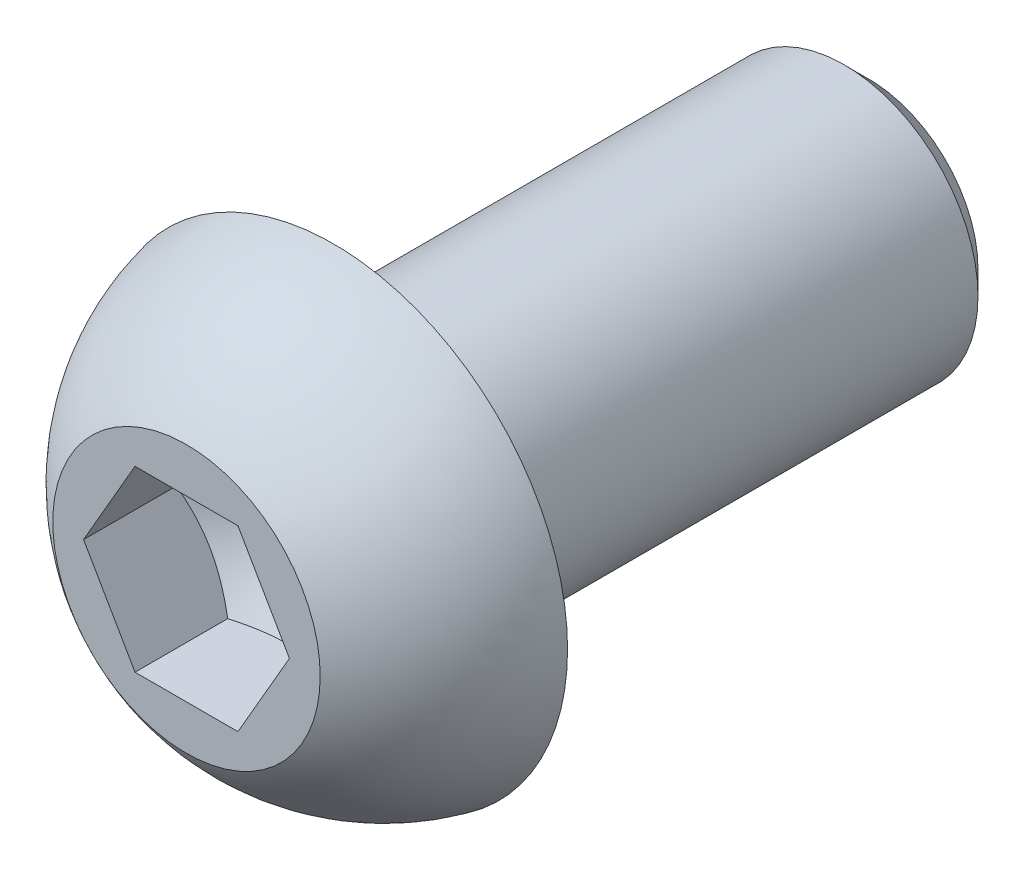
ISO-10303-21;
HEADER;
FILE_DESCRIPTION(('STEP AP214'),'2;1');
FILE_NAME('part.step','',(''),(''),'','','');
FILE_SCHEMA(('AUTOMOTIVE_DESIGN { 1 0 10303 214 1 1 1 1 }'));
ENDSEC;
DATA;
#1=APPLICATION_CONTEXT('core data for automotive mechanical design processes');
#2=APPLICATION_PROTOCOL_DEFINITION('international standard','automotive_design',2000,#1);
#3=PRODUCT_CONTEXT('',#1,'mechanical');
#4=PRODUCT('Part','Part','',(#3));
#5=PRODUCT_RELATED_PRODUCT_CATEGORY('part','',(#4));
#6=PRODUCT_DEFINITION_FORMATION('','',#4);
#7=PRODUCT_DEFINITION_CONTEXT('part definition',#1,'design');
#8=PRODUCT_DEFINITION('design','',#6,#7);
#9=PRODUCT_DEFINITION_SHAPE('','',#8);
#10=(LENGTH_UNIT() NAMED_UNIT(*) SI_UNIT(.MILLI.,.METRE.));
#11=(NAMED_UNIT(*) PLANE_ANGLE_UNIT() SI_UNIT($,.RADIAN.));
#12=(NAMED_UNIT(*) SI_UNIT($,.STERADIAN.) SOLID_ANGLE_UNIT());
#13=UNCERTAINTY_MEASURE_WITH_UNIT(LENGTH_MEASURE(1.E-05),#10,'distance_accuracy_value','');
#14=(GEOMETRIC_REPRESENTATION_CONTEXT(3) GLOBAL_UNCERTAINTY_ASSIGNED_CONTEXT((#13)) GLOBAL_UNIT_ASSIGNED_CONTEXT((#10,
#11,#12)) REPRESENTATION_CONTEXT('',''));
#15=CARTESIAN_POINT('',(0.,0.,0.));
#16=DIRECTION('',(0.,0.,1.));
#17=DIRECTION('',(1.,0.,0.));
#18=AXIS2_PLACEMENT_3D('',#15,#16,#17);
#19=CARTESIAN_POINT('',(0.,3.,3.3));
#20=DIRECTION('',(0.,0.,-1.));
#21=DIRECTION('',(-1.,0.,0.));
#22=AXIS2_PLACEMENT_3D('',#19,#20,#21);
#23=PLANE('',#22);
#24=CARTESIAN_POINT('',(0.,0.,3.3));
#25=DIRECTION('',(0.,0.,1.));
#26=DIRECTION('',(1.,0.,0.));
#27=AXIS2_PLACEMENT_3D('',#24,#25,#26);
#28=CIRCLE('',#27,3.);
#29=CARTESIAN_POINT('',(3.,0.,3.3));
#30=VERTEX_POINT('',#29);
#31=EDGE_CURVE('E111',#30,#30,#28,.T.);
#32=ORIENTED_EDGE('',*,*,#31,.T.);
#33=EDGE_LOOP('',(#32));
#34=FACE_BOUND('',#33,.T.);
#35=DIRECTION('',(0.5,-0.866025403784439,0.));
#36=VECTOR('',#35,1.);
#37=CARTESIAN_POINT('',(1.1547,1.99999906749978,3.3));
#38=LINE('',#37,#36);
#39=CARTESIAN_POINT('',(1.1547,1.99999906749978,3.3));
#40=VERTEX_POINT('',#39);
#41=CARTESIAN_POINT('',(2.3094,0.,3.3));
#42=VERTEX_POINT('',#41);
#43=EDGE_CURVE('E32',#40,#42,#38,.T.);
#44=ORIENTED_EDGE('',*,*,#43,.T.);
#45=DIRECTION('',(-0.5,-0.866025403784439,0.));
#46=VECTOR('',#45,1.);
#47=CARTESIAN_POINT('',(2.3094,0.,3.3));
#48=LINE('',#47,#46);
#49=CARTESIAN_POINT('',(1.1547,-1.99999906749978,3.3));
#50=VERTEX_POINT('',#49);
#51=EDGE_CURVE('E335',#42,#50,#48,.T.);
#52=ORIENTED_EDGE('',*,*,#51,.T.);
#53=DIRECTION('',(-1.,0.,0.));
#54=VECTOR('',#53,1.);
#55=CARTESIAN_POINT('',(1.1547,-1.99999906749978,3.3));
#56=LINE('',#55,#54);
#57=CARTESIAN_POINT('',(-1.1547,-1.99999906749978,3.3));
#58=VERTEX_POINT('',#57);
#59=EDGE_CURVE('E338',#50,#58,#56,.T.);
#60=ORIENTED_EDGE('',*,*,#59,.T.);
#61=DIRECTION('',(-0.5,0.866025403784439,0.));
#62=VECTOR('',#61,1.);
#63=CARTESIAN_POINT('',(-1.1547,-1.99999906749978,3.3));
#64=LINE('',#63,#62);
#65=CARTESIAN_POINT('',(-2.3094,0.,3.3));
#66=VERTEX_POINT('',#65);
#67=EDGE_CURVE('E341',#58,#66,#64,.T.);
#68=ORIENTED_EDGE('',*,*,#67,.T.);
#69=DIRECTION('',(0.5,0.866025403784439,0.));
#70=VECTOR('',#69,1.);
#71=CARTESIAN_POINT('',(-2.3094,0.,3.3));
#72=LINE('',#71,#70);
#73=CARTESIAN_POINT('',(-1.1547,1.99999906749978,3.3));
#74=VERTEX_POINT('',#73);
#75=EDGE_CURVE('E97',#66,#74,#72,.T.);
#76=ORIENTED_EDGE('',*,*,#75,.T.);
#77=DIRECTION('',(1.,0.,0.));
#78=VECTOR('',#77,1.);
#79=CARTESIAN_POINT('',(-1.1547,1.99999906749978,3.3));
#80=LINE('',#79,#78);
#81=EDGE_CURVE('E93',#74,#40,#80,.T.);
#82=ORIENTED_EDGE('',*,*,#81,.T.);
#83=EDGE_LOOP('',(#44,#52,#60,#68,#76,#82));
#84=FACE_BOUND('',#83,.T.);
#85=ADVANCED_FACE('F17',(#34,#84),#23,.F.);
#86=CARTESIAN_POINT('',(0.,0.,-12.));
#87=DIRECTION('',(0.,0.,1.));
#88=DIRECTION('',(1.,0.,0.));
#89=AXIS2_PLACEMENT_3D('',#86,#87,#88);
#90=CONICAL_SURFACE('',#89,2.45875,0.785398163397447);
#91=CARTESIAN_POINT('',(0.,0.,-11.45875));
#92=DIRECTION('',(0.,0.,1.));
#93=DIRECTION('',(1.,0.,0.));
#94=AXIS2_PLACEMENT_3D('',#91,#92,#93);
#95=CIRCLE('',#94,3.);
#96=CARTESIAN_POINT('',(3.,0.,-11.45875));
#97=VERTEX_POINT('',#96);
#98=EDGE_CURVE('E11',#97,#97,#95,.T.);
#99=ORIENTED_EDGE('',*,*,#98,.F.);
#100=EDGE_LOOP('',(#99));
#101=FACE_BOUND('',#100,.T.);
#102=CARTESIAN_POINT('',(0.,0.,-12.));
#103=DIRECTION('',(0.,0.,1.));
#104=DIRECTION('',(1.,0.,0.));
#105=AXIS2_PLACEMENT_3D('',#102,#103,#104);
#106=CIRCLE('',#105,2.45875);
#107=CARTESIAN_POINT('',(2.45875,0.,-12.));
#108=VERTEX_POINT('',#107);
#109=EDGE_CURVE('E108',#108,#108,#106,.T.);
#110=ORIENTED_EDGE('',*,*,#109,.T.);
#111=EDGE_LOOP('',(#110));
#112=FACE_BOUND('',#111,.T.);
#113=ADVANCED_FACE('F19',(#101,#112),#90,.T.);
#114=CARTESIAN_POINT('',(0.,0.,-12.));
#115=DIRECTION('',(0.,0.,1.));
#116=DIRECTION('',(1.,0.,0.));
#117=AXIS2_PLACEMENT_3D('',#114,#115,#116);
#118=CYLINDRICAL_SURFACE('',#117,3.);
#119=CARTESIAN_POINT('',(0.,0.,0.));
#120=DIRECTION('',(0.,0.,1.));
#121=DIRECTION('',(1.,0.,0.));
#122=AXIS2_PLACEMENT_3D('',#119,#120,#121);
#123=CIRCLE('',#122,3.);
#124=CARTESIAN_POINT('',(3.,0.,0.));
#125=VERTEX_POINT('',#124);
#126=EDGE_CURVE('E25',#125,#125,#123,.T.);
#127=ORIENTED_EDGE('',*,*,#126,.F.);
#128=EDGE_LOOP('',(#127));
#129=FACE_BOUND('',#128,.T.);
#130=ORIENTED_EDGE('',*,*,#98,.T.);
#131=EDGE_LOOP('',(#130));
#132=FACE_BOUND('',#131,.T.);
#133=ADVANCED_FACE('F121',(#129,#132),#118,.T.);
#134=CARTESIAN_POINT('',(0.,3.,0.));
#135=DIRECTION('',(0.,0.,1.));
#136=DIRECTION('',(1.,0.,0.));
#137=AXIS2_PLACEMENT_3D('',#134,#135,#136);
#138=PLANE('',#137);
#139=CARTESIAN_POINT('',(0.,0.,0.));
#140=DIRECTION('',(0.,0.,1.));
#141=DIRECTION('',(1.,0.,0.));
#142=AXIS2_PLACEMENT_3D('',#139,#140,#141);
#143=CIRCLE('',#142,5.25);
#144=CARTESIAN_POINT('',(5.25,0.,0.));
#145=VERTEX_POINT('',#144);
#146=EDGE_CURVE('E114',#145,#145,#143,.T.);
#147=ORIENTED_EDGE('',*,*,#146,.F.);
#148=EDGE_LOOP('',(#147));
#149=FACE_BOUND('',#148,.T.);
#150=ORIENTED_EDGE('',*,*,#126,.T.);
#151=EDGE_LOOP('',(#150));
#152=FACE_BOUND('',#151,.T.);
#153=ADVANCED_FACE('F119',(#149,#152),#138,.F.);
#154=CARTESIAN_POINT('',(0.,0.,-1.08519463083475));
#155=DIRECTION('',(0.,0.,1.));
#156=DIRECTION('',(1.,0.,0.));
#157=AXIS2_PLACEMENT_3D('',#154,#155,#156);
#158=DEGENERATE_TOROIDAL_SURFACE('',#157,0.113381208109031,5.25,.T.);
#159=ORIENTED_EDGE('',*,*,#31,.F.);
#160=EDGE_LOOP('',(#159));
#161=FACE_BOUND('',#160,.T.);
#162=ORIENTED_EDGE('',*,*,#146,.T.);
#163=EDGE_LOOP('',(#162));
#164=FACE_BOUND('',#163,.T.);
#165=ADVANCED_FACE('F132',(#161,#164),#158,.T.);
#166=CARTESIAN_POINT('',(0.,0.,-12.));
#167=DIRECTION('',(0.,0.,1.));
#168=DIRECTION('',(1.,0.,0.));
#169=AXIS2_PLACEMENT_3D('',#166,#167,#168);
#170=PLANE('',#169);
#171=ORIENTED_EDGE('',*,*,#109,.F.);
#172=EDGE_LOOP('',(#171));
#173=FACE_BOUND('',#172,.T.);
#174=ADVANCED_FACE('F130',(#173),#170,.F.);
#175=CARTESIAN_POINT('',(1.1547,1.99999906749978,-0.113332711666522));
#176=DIRECTION('',(-0.866025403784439,-0.5,0.));
#177=DIRECTION('',(-0.5,0.866025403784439,0.));
#178=AXIS2_PLACEMENT_3D('',#175,#176,#177);
#179=PLANE('',#178);
#180=DIRECTION('',(0.,0.,1.));
#181=VECTOR('',#180,1.);
#182=CARTESIAN_POINT('',(2.3094,0.,-0.113332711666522));
#183=LINE('',#182,#181);
#184=CARTESIAN_POINT('',(2.3094,0.,1.22));
#185=VERTEX_POINT('',#184);
#186=EDGE_CURVE('E106',#185,#42,#183,.T.);
#187=ORIENTED_EDGE('',*,*,#186,.T.);
#188=ORIENTED_EDGE('',*,*,#43,.F.);
#189=DIRECTION('',(0.,0.,1.));
#190=VECTOR('',#189,1.);
#191=CARTESIAN_POINT('',(1.1547,1.99999906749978,-0.113332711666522));
#192=LINE('',#191,#190);
#193=CARTESIAN_POINT('',(1.1547,1.99999906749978,1.22));
#194=VERTEX_POINT('',#193);
#195=EDGE_CURVE('E87',#194,#40,#192,.T.);
#196=ORIENTED_EDGE('',*,*,#195,.F.);
#197=CARTESIAN_POINT('',(2.30940011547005,-2.00000000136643E-07,1.22000006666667));
#198=CARTESIAN_POINT('',(2.25865804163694,0.0878876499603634,1.19069561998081));
#199=CARTESIAN_POINT('',(2.20747796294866,0.176534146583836,1.16404475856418));
#200=CARTESIAN_POINT('',(2.10423165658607,0.355361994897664,1.11752647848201));
#201=CARTESIAN_POINT('',(2.0521635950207,0.445546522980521,1.09767551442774));
#202=CARTESIAN_POINT('',(1.94867272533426,0.624797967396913,1.06677605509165));
#203=CARTESIAN_POINT('',(1.89726583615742,0.713837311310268,1.05552188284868));
#204=CARTESIAN_POINT('',(1.79421029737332,0.892334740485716,1.04208925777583));
#205=CARTESIAN_POINT('',(1.74256202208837,0.981792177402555,1.03989967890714));
#206=CARTESIAN_POINT('',(1.64606274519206,1.14893382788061,1.04446636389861));
#207=CARTESIAN_POINT('',(1.60119726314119,1.2266431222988,1.05010135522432));
#208=CARTESIAN_POINT('',(1.51175858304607,1.38155546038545,1.06795736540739));
#209=CARTESIAN_POINT('',(1.46718569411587,1.45875796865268,1.08018447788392));
#210=CARTESIAN_POINT('',(1.37756276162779,1.61398944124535,1.11074989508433));
#211=CARTESIAN_POINT('',(1.3325240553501,1.69199876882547,1.12921770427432));
#212=CARTESIAN_POINT('',(1.2431182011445,1.84685425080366,1.17113182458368));
#213=CARTESIAN_POINT('',(1.19874990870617,1.92370238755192,1.19456829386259));
#214=CARTESIAN_POINT('',(1.15469988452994,1.99999926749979,1.22000006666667));
#215=B_SPLINE_CURVE_WITH_KNOTS('',3,(#197,#198,#199,#200,#201,#202,#203,#204,#205,#206,#207,
#208,#209,#210,#211,#212,#213,#214),.UNSPECIFIED.,.F.,.F.,(4,2,2,2,2,2,2,2,4),(0.,
0.317015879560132,0.634793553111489,0.944707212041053,1.25424036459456,1.52370723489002,
1.79342362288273,2.06912103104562,2.3442773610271),.UNSPECIFIED.);
#216=EDGE_CURVE('E80',#185,#194,#215,.T.);
#217=ORIENTED_EDGE('',*,*,#216,.F.);
#218=EDGE_LOOP('',(#187,#188,#196,#217));
#219=FACE_BOUND('',#218,.T.);
#220=ADVANCED_FACE('F88',(#219),#179,.T.);
#221=CARTESIAN_POINT('',(2.3094,0.,-0.113332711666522));
#222=DIRECTION('',(-0.866025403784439,0.5,0.));
#223=DIRECTION('',(0.5,0.866025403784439,0.));
#224=AXIS2_PLACEMENT_3D('',#221,#222,#223);
#225=PLANE('',#224);
#226=DIRECTION('',(0.,0.,1.));
#227=VECTOR('',#226,1.);
#228=CARTESIAN_POINT('',(1.1547,-1.99999906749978,-0.113332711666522));
#229=LINE('',#228,#227);
#230=CARTESIAN_POINT('',(1.1547,-1.99999906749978,1.22));
#231=VERTEX_POINT('',#230);
#232=EDGE_CURVE('E104',#231,#50,#229,.T.);
#233=ORIENTED_EDGE('',*,*,#232,.T.);
#234=ORIENTED_EDGE('',*,*,#51,.F.);
#235=ORIENTED_EDGE('',*,*,#186,.F.);
#236=CARTESIAN_POINT('',(1.15469988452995,-1.99999926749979,1.22000006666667));
#237=CARTESIAN_POINT('',(1.20544195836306,-1.91211141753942,1.19069561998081));
#238=CARTESIAN_POINT('',(1.25662203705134,-1.82346492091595,1.16404475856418));
#239=CARTESIAN_POINT('',(1.35986834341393,-1.64463707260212,1.11752647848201));
#240=CARTESIAN_POINT('',(1.41193640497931,-1.55445254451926,1.09767551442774));
#241=CARTESIAN_POINT('',(1.51542727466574,-1.37520110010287,1.06677605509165));
#242=CARTESIAN_POINT('',(1.56683416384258,-1.28616175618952,1.05552188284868));
#243=CARTESIAN_POINT('',(1.66988970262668,-1.10766432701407,1.04208925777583));
#244=CARTESIAN_POINT('',(1.72153797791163,-1.01820689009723,1.03989967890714));
#245=CARTESIAN_POINT('',(1.81803725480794,-0.851065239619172,1.04446636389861));
#246=CARTESIAN_POINT('',(1.86290273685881,-0.773355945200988,1.05010135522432));
#247=CARTESIAN_POINT('',(1.95234141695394,-0.618443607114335,1.06795736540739));
#248=CARTESIAN_POINT('',(1.99691430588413,-0.541241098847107,1.08018447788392));
#249=CARTESIAN_POINT('',(2.08653723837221,-0.386009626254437,1.11074989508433));
#250=CARTESIAN_POINT('',(2.1315759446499,-0.308000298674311,1.12921770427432));
#251=CARTESIAN_POINT('',(2.2209817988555,-0.153144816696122,1.17113182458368));
#252=CARTESIAN_POINT('',(2.26535009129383,-0.0762966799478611,1.19456829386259));
#253=CARTESIAN_POINT('',(2.30940011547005,1.99999999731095E-07,1.22000006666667));
#254=B_SPLINE_CURVE_WITH_KNOTS('',3,(#236,#237,#238,#239,#240,#241,#242,#243,#244,#245,#246,
#247,#248,#249,#250,#251,#252,#253),.UNSPECIFIED.,.F.,.F.,(4,2,2,2,2,2,2,2,4),(0.,
0.317015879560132,0.63479355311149,0.944707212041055,1.25424036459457,1.52370723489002,
1.79342362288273,2.06912103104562,2.3442773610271),.UNSPECIFIED.);
#255=EDGE_CURVE('E84',#231,#185,#254,.T.);
#256=ORIENTED_EDGE('',*,*,#255,.F.);
#257=EDGE_LOOP('',(#233,#234,#235,#256));
#258=FACE_BOUND('',#257,.T.);
#259=ADVANCED_FACE('F140',(#258),#225,.T.);
#260=CARTESIAN_POINT('',(1.1547,-1.99999906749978,-0.113332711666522));
#261=DIRECTION('',(0.,1.,0.));
#262=DIRECTION('',(1.,0.,0.));
#263=AXIS2_PLACEMENT_3D('',#260,#261,#262);
#264=PLANE('',#263);
#265=DIRECTION('',(0.,0.,1.));
#266=VECTOR('',#265,1.);
#267=CARTESIAN_POINT('',(-1.1547,-1.99999906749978,-0.113332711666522));
#268=LINE('',#267,#266);
#269=CARTESIAN_POINT('',(-1.1547,-1.99999906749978,1.22));
#270=VERTEX_POINT('',#269);
#271=EDGE_CURVE('E102',#270,#58,#268,.T.);
#272=ORIENTED_EDGE('',*,*,#271,.T.);
#273=ORIENTED_EDGE('',*,*,#59,.F.);
#274=ORIENTED_EDGE('',*,*,#232,.F.);
#275=CARTESIAN_POINT('',(-2.99028884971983,-1.99999906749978,1.96367023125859));
#276=CARTESIAN_POINT('',(-2.90392200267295,-1.99999906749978,1.92223468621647));
#277=CARTESIAN_POINT('',(-2.81734475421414,-1.99999906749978,1.88122952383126));
#278=CARTESIAN_POINT('',(-2.64365731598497,-1.99999906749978,1.80032411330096));
#279=CARTESIAN_POINT('',(-2.55654703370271,-1.99999906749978,1.76042406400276));
#280=CARTESIAN_POINT('',(-2.38118192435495,-1.99999906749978,1.68175012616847));
#281=CARTESIAN_POINT('',(-2.29292335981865,-1.99999906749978,1.64298453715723));
#282=CARTESIAN_POINT('',(-2.11566562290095,-1.99999906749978,1.56719170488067));
#283=CARTESIAN_POINT('',(-2.02666648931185,-1.99999906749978,1.53016437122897));
#284=CARTESIAN_POINT('',(-1.84544164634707,-1.99999906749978,1.45736806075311));
#285=CARTESIAN_POINT('',(-1.75319241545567,-1.99999906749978,1.42165729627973));
#286=CARTESIAN_POINT('',(-1.56757813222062,-1.99999906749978,1.35320478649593));
#287=CARTESIAN_POINT('',(-1.47421295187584,-1.99999906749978,1.32046338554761));
#288=CARTESIAN_POINT('',(-1.28643386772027,-1.99999906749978,1.25888591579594));
#289=CARTESIAN_POINT('',(-1.19202295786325,-1.99999906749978,1.23004081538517));
#290=CARTESIAN_POINT('',(-1.00184812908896,-1.99999906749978,1.17724234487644));
#291=CARTESIAN_POINT('',(-0.906084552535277,-1.99999906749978,1.15328775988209));
#292=CARTESIAN_POINT('',(-0.713403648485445,-1.99999906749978,1.11154750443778));
#293=CARTESIAN_POINT('',(-0.616489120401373,-1.99999906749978,1.09374916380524));
#294=CARTESIAN_POINT('',(-0.421576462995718,-1.99999906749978,1.06548602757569));
#295=CARTESIAN_POINT('',(-0.323578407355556,-1.99999906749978,1.05502073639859));
#296=CARTESIAN_POINT('',(-0.12821235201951,-1.99999906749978,1.04239776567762));
#297=CARTESIAN_POINT('',(-0.0308508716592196,-1.99999906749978,1.04014205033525));
#298=CARTESIAN_POINT('',(0.163710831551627,-1.99999906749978,1.04386608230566));
#299=CARTESIAN_POINT('',(0.260911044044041,-1.99999906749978,1.04984633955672));
#300=CARTESIAN_POINT('',(0.500738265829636,-1.99999906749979,1.07423686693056));
#301=CARTESIAN_POINT('',(0.64290057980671,-1.99999906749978,1.0972180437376));
#302=CARTESIAN_POINT('',(0.924460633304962,-1.99999906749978,1.15647980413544));
#303=CARTESIAN_POINT('',(1.06385482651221,-1.99999906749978,1.19277641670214));
#304=CARTESIAN_POINT('',(1.27233418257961,-1.99999906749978,1.25477991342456));
#305=CARTESIAN_POINT('',(1.3424969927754,-1.99999906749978,1.27699669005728));
#306=CARTESIAN_POINT('',(1.4820922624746,-1.99999906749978,1.32348542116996));
#307=CARTESIAN_POINT('',(1.55152514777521,-1.99999906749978,1.34775609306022));
#308=CARTESIAN_POINT('',(1.68975335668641,-1.99999906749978,1.39800013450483));
#309=CARTESIAN_POINT('',(1.75854879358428,-1.99999906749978,1.4239731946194));
#310=CARTESIAN_POINT('',(1.8955975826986,-1.99999906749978,1.47734107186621));
#311=CARTESIAN_POINT('',(1.96385084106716,-1.99999906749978,1.50473612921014));
#312=CARTESIAN_POINT('',(2.13806939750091,-1.99999906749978,1.5764177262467));
#313=CARTESIAN_POINT('',(2.24368634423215,-1.99999906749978,1.62155001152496));
#314=CARTESIAN_POINT('',(2.45396648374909,-1.99999906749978,1.71399021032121));
#315=CARTESIAN_POINT('',(2.55862960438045,-1.99999906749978,1.76129828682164));
#316=CARTESIAN_POINT('',(2.87150603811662,-1.99999906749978,1.90571921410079));
#317=CARTESIAN_POINT('',(3.07857147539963,-1.99999906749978,2.00531395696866));
#318=CARTESIAN_POINT('',(3.49093332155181,-1.99999906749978,2.2086804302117));
#319=CARTESIAN_POINT('',(3.69622724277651,-1.99999906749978,2.31245714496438));
#320=CARTESIAN_POINT('',(4.10540852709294,-1.99999906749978,2.52267901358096));
#321=CARTESIAN_POINT('',(4.30929606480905,-1.99999906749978,2.62912382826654));
#322=CARTESIAN_POINT('',(4.69689950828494,-1.99999906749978,2.83371795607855));
#323=CARTESIAN_POINT('',(4.8807029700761,-1.99999906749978,2.93170196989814));
#324=CARTESIAN_POINT('',(5.24771864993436,-1.99999906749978,3.12878643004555));
#325=CARTESIAN_POINT('',(5.43093084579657,-1.99999906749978,3.22788691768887));
#326=CARTESIAN_POINT('',(5.79643429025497,-1.99999906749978,3.42667121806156));
#327=CARTESIAN_POINT('',(5.97872669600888,-1.99999906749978,3.52635290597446));
#328=CARTESIAN_POINT('',(6.34294295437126,-1.99999906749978,3.72636506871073));
#329=CARTESIAN_POINT('',(6.52486682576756,-1.99999906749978,3.82669550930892));
#330=CARTESIAN_POINT('',(6.70665829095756,-1.99999906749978,3.92726384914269));
#331=B_SPLINE_CURVE_WITH_KNOTS('',3,(#275,#276,#277,#278,#279,#280,#281,#282,#283,#284,#285,
#286,#287,#288,#289,#290,#291,#292,#293,#294,#295,#296,#297,#298,#299,#300,#301,#302,#303,#304,
#305,#306,#307,#308,#309,#310,#311,#312,#313,#314,#315,#316,#317,#318,#319,#320,#321,#322,#323,
#324,#325,#326,#327,#328,#329,#330),.UNSPECIFIED.,.F.,.F.,(4,2,2,2,2,2,2,2,2,2,2,2,2,2,2,2,2,2,
2,2,2,2,2,2,2,2,2,4),(0.,0.287380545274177,0.574812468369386,0.863987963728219,1.15314840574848,
1.44986914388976,1.746624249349,2.04267922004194,2.33866055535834,2.63402905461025,
2.92937759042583,3.22118738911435,3.51301525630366,3.94415234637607,4.37581014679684,
4.59657452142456,4.81720203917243,5.03778956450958,5.25841447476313,5.6029464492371,
5.94750427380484,6.63673372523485,7.32681046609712,8.01679992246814,8.64166451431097,
9.26655230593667,9.88985069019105,10.5131164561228),.UNSPECIFIED.);
#332=EDGE_CURVE('E319',#270,#231,#331,.T.);
#333=ORIENTED_EDGE('',*,*,#332,.F.);
#334=EDGE_LOOP('',(#272,#273,#274,#333));
#335=FACE_BOUND('',#334,.T.);
#336=ADVANCED_FACE('F196',(#335),#264,.T.);
#337=CARTESIAN_POINT('',(-1.1547,-1.99999906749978,-0.113332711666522));
#338=DIRECTION('',(0.866025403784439,0.5,0.));
#339=DIRECTION('',(0.5,-0.866025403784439,0.));
#340=AXIS2_PLACEMENT_3D('',#337,#338,#339);
#341=PLANE('',#340);
#342=DIRECTION('',(0.,0.,1.));
#343=VECTOR('',#342,1.);
#344=CARTESIAN_POINT('',(-2.3094,0.,-0.113332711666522));
#345=LINE('',#344,#343);
#346=CARTESIAN_POINT('',(-2.3094,0.,1.22));
#347=VERTEX_POINT('',#346);
#348=EDGE_CURVE('E95',#347,#66,#345,.T.);
#349=ORIENTED_EDGE('',*,*,#348,.T.);
#350=ORIENTED_EDGE('',*,*,#67,.F.);
#351=ORIENTED_EDGE('',*,*,#271,.F.);
#352=CARTESIAN_POINT('',(-2.30940011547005,2.00000000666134E-07,1.22000006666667));
#353=CARTESIAN_POINT('',(-2.25865804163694,-0.0878876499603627,1.19069561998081));
#354=CARTESIAN_POINT('',(-2.20747796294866,-0.176534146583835,1.16404475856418));
#355=CARTESIAN_POINT('',(-2.10423165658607,-0.355361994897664,1.11752647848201));
#356=CARTESIAN_POINT('',(-2.0521635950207,-0.445546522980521,1.09767551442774));
#357=CARTESIAN_POINT('',(-1.94867272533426,-0.624797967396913,1.06677605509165));
#358=CARTESIAN_POINT('',(-1.89726583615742,-0.713837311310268,1.05552188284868));
#359=CARTESIAN_POINT('',(-1.79421029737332,-0.892334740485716,1.04208925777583));
#360=CARTESIAN_POINT('',(-1.74256202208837,-0.981792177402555,1.03989967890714));
#361=CARTESIAN_POINT('',(-1.64606274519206,-1.14893382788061,1.04446636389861));
#362=CARTESIAN_POINT('',(-1.60119726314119,-1.2266431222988,1.05010135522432));
#363=CARTESIAN_POINT('',(-1.51175858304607,-1.38155546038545,1.06795736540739));
#364=CARTESIAN_POINT('',(-1.46718569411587,-1.45875796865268,1.08018447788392));
#365=CARTESIAN_POINT('',(-1.37756276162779,-1.61398944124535,1.11074989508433));
#366=CARTESIAN_POINT('',(-1.3325240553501,-1.69199876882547,1.12921770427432));
#367=CARTESIAN_POINT('',(-1.2431182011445,-1.84685425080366,1.17113182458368));
#368=CARTESIAN_POINT('',(-1.19874990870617,-1.92370238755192,1.19456829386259));
#369=CARTESIAN_POINT('',(-1.15469988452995,-1.99999926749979,1.22000006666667));
#370=B_SPLINE_CURVE_WITH_KNOTS('',3,(#352,#353,#354,#355,#356,#357,#358,#359,#360,#361,#362,
#363,#364,#365,#366,#367,#368,#369),.UNSPECIFIED.,.F.,.F.,(4,2,2,2,2,2,2,2,4),(0.,
0.317015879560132,0.634793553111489,0.944707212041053,1.25424036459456,1.52370723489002,
1.79342362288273,2.06912103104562,2.3442773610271),.UNSPECIFIED.);
#371=EDGE_CURVE('E313',#347,#270,#370,.T.);
#372=ORIENTED_EDGE('',*,*,#371,.F.);
#373=EDGE_LOOP('',(#349,#350,#351,#372));
#374=FACE_BOUND('',#373,.T.);
#375=ADVANCED_FACE('F208',(#374),#341,.T.);
#376=CARTESIAN_POINT('',(-2.3094,0.,-0.113332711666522));
#377=DIRECTION('',(0.866025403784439,-0.5,0.));
#378=DIRECTION('',(-0.5,-0.866025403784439,0.));
#379=AXIS2_PLACEMENT_3D('',#376,#377,#378);
#380=PLANE('',#379);
#381=DIRECTION('',(0.,0.,1.));
#382=VECTOR('',#381,1.);
#383=CARTESIAN_POINT('',(-1.1547,1.99999906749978,-0.113332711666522));
#384=LINE('',#383,#382);
#385=CARTESIAN_POINT('',(-1.1547,1.99999906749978,1.22));
#386=VERTEX_POINT('',#385);
#387=EDGE_CURVE('E92',#386,#74,#384,.T.);
#388=ORIENTED_EDGE('',*,*,#387,.T.);
#389=ORIENTED_EDGE('',*,*,#75,.F.);
#390=ORIENTED_EDGE('',*,*,#348,.F.);
#391=CARTESIAN_POINT('',(-1.15469988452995,1.99999926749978,1.22000006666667));
#392=CARTESIAN_POINT('',(-1.20544195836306,1.91211141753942,1.19069561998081));
#393=CARTESIAN_POINT('',(-1.25662203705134,1.82346492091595,1.16404475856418));
#394=CARTESIAN_POINT('',(-1.35986834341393,1.64463707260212,1.11752647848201));
#395=CARTESIAN_POINT('',(-1.41193640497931,1.55445254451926,1.09767551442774));
#396=CARTESIAN_POINT('',(-1.51542727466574,1.37520110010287,1.06677605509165));
#397=CARTESIAN_POINT('',(-1.56683416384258,1.28616175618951,1.05552188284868));
#398=CARTESIAN_POINT('',(-1.66988970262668,1.10766432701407,1.04208925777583));
#399=CARTESIAN_POINT('',(-1.72153797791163,1.01820689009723,1.03989967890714));
#400=CARTESIAN_POINT('',(-1.81803725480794,0.851065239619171,1.04446636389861));
#401=CARTESIAN_POINT('',(-1.86290273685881,0.773355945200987,1.05010135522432));
#402=CARTESIAN_POINT('',(-1.95234141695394,0.618443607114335,1.06795736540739));
#403=CARTESIAN_POINT('',(-1.99691430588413,0.541241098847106,1.08018447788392));
#404=CARTESIAN_POINT('',(-2.08653723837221,0.386009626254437,1.11074989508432));
#405=CARTESIAN_POINT('',(-2.1315759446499,0.308000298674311,1.12921770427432));
#406=CARTESIAN_POINT('',(-2.2209817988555,0.153144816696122,1.17113182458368));
#407=CARTESIAN_POINT('',(-2.26535009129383,0.0762966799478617,1.19456829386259));
#408=CARTESIAN_POINT('',(-2.30940011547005,-1.999999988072E-07,1.22000006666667));
#409=B_SPLINE_CURVE_WITH_KNOTS('',3,(#391,#392,#393,#394,#395,#396,#397,#398,#399,#400,#401,
#402,#403,#404,#405,#406,#407,#408),.UNSPECIFIED.,.F.,.F.,(4,2,2,2,2,2,2,2,4),(0.,
0.317015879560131,0.634793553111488,0.944707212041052,1.25424036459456,1.52370723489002,
1.79342362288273,2.06912103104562,2.34427736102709),.UNSPECIFIED.);
#410=EDGE_CURVE('E40',#386,#347,#409,.T.);
#411=ORIENTED_EDGE('',*,*,#410,.F.);
#412=EDGE_LOOP('',(#388,#389,#390,#411));
#413=FACE_BOUND('',#412,.T.);
#414=ADVANCED_FACE('F220',(#413),#380,.T.);
#415=CARTESIAN_POINT('',(-1.1547,1.99999906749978,-0.113332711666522));
#416=DIRECTION('',(0.,-1.,0.));
#417=DIRECTION('',(-1.,0.,0.));
#418=AXIS2_PLACEMENT_3D('',#415,#416,#417);
#419=PLANE('',#418);
#420=ORIENTED_EDGE('',*,*,#195,.T.);
#421=ORIENTED_EDGE('',*,*,#81,.F.);
#422=ORIENTED_EDGE('',*,*,#387,.F.);
#423=CARTESIAN_POINT('',(-2.99028884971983,1.99999906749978,1.96367023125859));
#424=CARTESIAN_POINT('',(-2.90392200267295,1.99999906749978,1.92223468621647));
#425=CARTESIAN_POINT('',(-2.81734475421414,1.99999906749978,1.88122952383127));
#426=CARTESIAN_POINT('',(-2.64365731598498,1.99999906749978,1.80032411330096));
#427=CARTESIAN_POINT('',(-2.55654703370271,1.99999906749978,1.76042406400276));
#428=CARTESIAN_POINT('',(-2.38118192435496,1.99999906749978,1.68175012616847));
#429=CARTESIAN_POINT('',(-2.29292335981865,1.99999906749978,1.64298453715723));
#430=CARTESIAN_POINT('',(-2.11566562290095,1.99999906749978,1.56719170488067));
#431=CARTESIAN_POINT('',(-2.02666648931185,1.99999906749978,1.53016437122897));
#432=CARTESIAN_POINT('',(-1.84544164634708,1.99999906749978,1.45736806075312));
#433=CARTESIAN_POINT('',(-1.75319241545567,1.99999906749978,1.42165729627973));
#434=CARTESIAN_POINT('',(-1.56757813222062,1.99999906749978,1.35320478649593));
#435=CARTESIAN_POINT('',(-1.47421295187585,1.99999906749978,1.32046338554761));
#436=CARTESIAN_POINT('',(-1.28643386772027,1.99999906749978,1.25888591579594));
#437=CARTESIAN_POINT('',(-1.19202295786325,1.99999906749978,1.23004081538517));
#438=CARTESIAN_POINT('',(-1.00184812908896,1.99999906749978,1.17724234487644));
#439=CARTESIAN_POINT('',(-0.906084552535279,1.99999906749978,1.15328775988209));
#440=CARTESIAN_POINT('',(-0.713403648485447,1.99999906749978,1.11154750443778));
#441=CARTESIAN_POINT('',(-0.616489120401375,1.99999906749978,1.09374916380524));
#442=CARTESIAN_POINT('',(-0.42157646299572,1.99999906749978,1.06548602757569));
#443=CARTESIAN_POINT('',(-0.323578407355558,1.99999906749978,1.05502073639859));
#444=CARTESIAN_POINT('',(-0.128212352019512,1.99999906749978,1.04239776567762));
#445=CARTESIAN_POINT('',(-0.0308508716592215,1.99999906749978,1.04014205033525));
#446=CARTESIAN_POINT('',(0.163710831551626,1.99999906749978,1.04386608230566));
#447=CARTESIAN_POINT('',(0.26091104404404,1.99999906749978,1.04984633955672));
#448=CARTESIAN_POINT('',(0.500738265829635,1.99999906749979,1.07423686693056));
#449=CARTESIAN_POINT('',(0.642900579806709,1.99999906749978,1.0972180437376));
#450=CARTESIAN_POINT('',(0.924460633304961,1.99999906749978,1.15647980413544));
#451=CARTESIAN_POINT('',(1.06385482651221,1.99999906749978,1.19277641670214));
#452=CARTESIAN_POINT('',(1.27233418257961,1.99999906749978,1.25477991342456));
#453=CARTESIAN_POINT('',(1.3424969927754,1.99999906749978,1.27699669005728));
#454=CARTESIAN_POINT('',(1.4820922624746,1.99999906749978,1.32348542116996));
#455=CARTESIAN_POINT('',(1.55152514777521,1.99999906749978,1.34775609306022));
#456=CARTESIAN_POINT('',(1.68975335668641,1.99999906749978,1.39800013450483));
#457=CARTESIAN_POINT('',(1.75854879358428,1.99999906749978,1.4239731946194));
#458=CARTESIAN_POINT('',(1.8955975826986,1.99999906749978,1.47734107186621));
#459=CARTESIAN_POINT('',(1.96385084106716,1.99999906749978,1.50473612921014));
#460=CARTESIAN_POINT('',(2.13806939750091,1.99999906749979,1.5764177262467));
#461=CARTESIAN_POINT('',(2.24368634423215,1.99999906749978,1.62155001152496));
#462=CARTESIAN_POINT('',(2.45396648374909,1.99999906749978,1.71399021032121));
#463=CARTESIAN_POINT('',(2.55862960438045,1.99999906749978,1.76129828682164));
#464=CARTESIAN_POINT('',(2.87150603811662,1.99999906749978,1.90571921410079));
#465=CARTESIAN_POINT('',(3.07857147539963,1.99999906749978,2.00531395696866));
#466=CARTESIAN_POINT('',(3.49093332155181,1.99999906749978,2.2086804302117));
#467=CARTESIAN_POINT('',(3.69622724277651,1.99999906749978,2.31245714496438));
#468=CARTESIAN_POINT('',(4.10540852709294,1.99999906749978,2.52267901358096));
#469=CARTESIAN_POINT('',(4.30929606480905,1.99999906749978,2.62912382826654));
#470=CARTESIAN_POINT('',(4.69689950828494,1.99999906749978,2.83371795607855));
#471=CARTESIAN_POINT('',(4.8807029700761,1.99999906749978,2.93170196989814));
#472=CARTESIAN_POINT('',(5.24771864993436,1.99999906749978,3.12878643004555));
#473=CARTESIAN_POINT('',(5.43093084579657,1.99999906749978,3.22788691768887));
#474=CARTESIAN_POINT('',(5.79643429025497,1.99999906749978,3.42667121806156));
#475=CARTESIAN_POINT('',(5.97872669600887,1.99999906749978,3.52635290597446));
#476=CARTESIAN_POINT('',(6.34294295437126,1.99999906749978,3.72636506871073));
#477=CARTESIAN_POINT('',(6.52486682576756,1.99999906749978,3.82669550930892));
#478=CARTESIAN_POINT('',(6.70665829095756,1.99999906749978,3.92726384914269));
#479=B_SPLINE_CURVE_WITH_KNOTS('',3,(#423,#424,#425,#426,#427,#428,#429,#430,#431,#432,#433,
#434,#435,#436,#437,#438,#439,#440,#441,#442,#443,#444,#445,#446,#447,#448,#449,#450,#451,#452,
#453,#454,#455,#456,#457,#458,#459,#460,#461,#462,#463,#464,#465,#466,#467,#468,#469,#470,#471,
#472,#473,#474,#475,#476,#477,#478),.UNSPECIFIED.,.F.,.F.,(4,2,2,2,2,2,2,2,2,2,2,2,2,2,2,2,2,2,
2,2,2,2,2,2,2,2,2,4),(0.,0.287380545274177,0.574812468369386,0.86398796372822,1.15314840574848,
1.44986914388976,1.74662424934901,2.04267922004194,2.33866055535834,2.63402905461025,
2.92937759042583,3.22118738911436,3.51301525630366,3.94415234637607,4.37581014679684,
4.59657452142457,4.81720203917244,5.03778956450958,5.25841447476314,5.6029464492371,
5.94750427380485,6.63673372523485,7.32681046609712,8.01679992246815,8.64166451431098,
9.26655230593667,9.88985069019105,10.5131164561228),.UNSPECIFIED.);
#480=EDGE_CURVE('E81',#194,#386,#479,.F.);
#481=ORIENTED_EDGE('',*,*,#480,.F.);
#482=EDGE_LOOP('',(#420,#421,#422,#481));
#483=FACE_BOUND('',#482,.T.);
#484=ADVANCED_FACE('F76',(#483),#419,.T.);
#485=CARTESIAN_POINT('',(0.,0.,-0.113332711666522));
#486=DIRECTION('',(0.,0.,1.));
#487=DIRECTION('',(1.,0.,0.));
#488=AXIS2_PLACEMENT_3D('',#485,#486,#487);
#489=CONICAL_SURFACE('',#488,0.,1.0471975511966);
#490=CARTESIAN_POINT('',(0.,0.,-0.113332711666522));
#491=VERTEX_POINT('',#490);
#492=VERTEX_LOOP('',#491);
#493=FACE_BOUND('',#492,.T.);
#494=ORIENTED_EDGE('',*,*,#216,.T.);
#495=ORIENTED_EDGE('',*,*,#480,.T.);
#496=ORIENTED_EDGE('',*,*,#410,.T.);
#497=ORIENTED_EDGE('',*,*,#371,.T.);
#498=ORIENTED_EDGE('',*,*,#332,.T.);
#499=ORIENTED_EDGE('',*,*,#255,.T.);
#500=EDGE_LOOP('',(#494,#495,#496,#497,#498,#499));
#501=FACE_BOUND('',#500,.T.);
#502=ADVANCED_FACE('F73',(#493,#501),#489,.F.);
#503=CLOSED_SHELL('',(#85,#113,#133,#153,#165,#174,#220,#259,#336,#375,#414,#484,#502));
#504=MANIFOLD_SOLID_BREP('B1',#503);
#505=ADVANCED_BREP_SHAPE_REPRESENTATION('',(#18,#504),#14);
#506=SHAPE_DEFINITION_REPRESENTATION(#9,#505);
ENDSEC;
END-ISO-10303-21;
